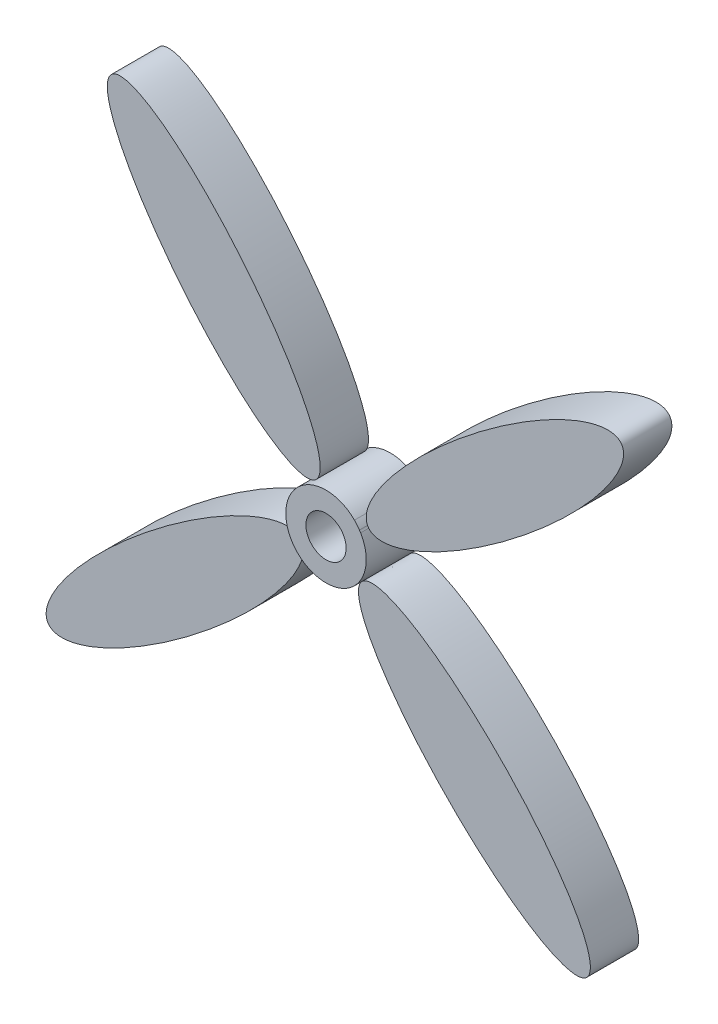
ISO-10303-21;
HEADER;
FILE_DESCRIPTION(('STEP AP214'),'2;1');
FILE_NAME('part.step','',(''),(''),'','','');
FILE_SCHEMA(('AUTOMOTIVE_DESIGN { 1 0 10303 214 1 1 1 1 }'));
ENDSEC;
DATA;
#1=APPLICATION_CONTEXT('core data for automotive mechanical design processes');
#2=APPLICATION_PROTOCOL_DEFINITION('international standard','automotive_design',2000,#1);
#3=PRODUCT_CONTEXT('',#1,'mechanical');
#4=PRODUCT('Part','Part','',(#3));
#5=PRODUCT_RELATED_PRODUCT_CATEGORY('part','',(#4));
#6=PRODUCT_DEFINITION_FORMATION('','',#4);
#7=PRODUCT_DEFINITION_CONTEXT('part definition',#1,'design');
#8=PRODUCT_DEFINITION('design','',#6,#7);
#9=PRODUCT_DEFINITION_SHAPE('','',#8);
#10=(LENGTH_UNIT() NAMED_UNIT(*) SI_UNIT(.MILLI.,.METRE.));
#11=(NAMED_UNIT(*) PLANE_ANGLE_UNIT() SI_UNIT($,.RADIAN.));
#12=(NAMED_UNIT(*) SI_UNIT($,.STERADIAN.) SOLID_ANGLE_UNIT());
#13=UNCERTAINTY_MEASURE_WITH_UNIT(LENGTH_MEASURE(1.E-05),#10,'distance_accuracy_value','');
#14=(GEOMETRIC_REPRESENTATION_CONTEXT(3) GLOBAL_UNCERTAINTY_ASSIGNED_CONTEXT((#13)) GLOBAL_UNIT_ASSIGNED_CONTEXT((#10,
#11,#12)) REPRESENTATION_CONTEXT('',''));
#15=CARTESIAN_POINT('',(0.,0.,0.));
#16=DIRECTION('',(0.,0.,1.));
#17=DIRECTION('',(1.,0.,0.));
#18=AXIS2_PLACEMENT_3D('',#15,#16,#17);
#19=CARTESIAN_POINT('',(-9.49213863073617,12.6733773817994,-1.905));
#20=DIRECTION('',(0.,0.,1.));
#21=DIRECTION('',(0.632158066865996,-0.774839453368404,0.));
#22=AXIS2_PLACEMENT_3D('',#19,#20,#21);
#23=ELLIPSE('',#22,12.7,3.175);
#24=DIRECTION('',(0.,0.,1.));
#25=VECTOR('',#24,1.);
#26=SURFACE_OF_LINEAR_EXTRUSION('',#23,#25);
#27=CARTESIAN_POINT('',(-1.46373118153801,2.83291632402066,-1.905));
#28=VERTEX_POINT('',#27);
#29=EDGE_CURVE('E49',#28,#28,#23,.T.);
#30=ORIENTED_EDGE('',*,*,#29,.T.);
#31=EDGE_LOOP('',(#30));
#32=FACE_BOUND('',#31,.T.);
#33=CARTESIAN_POINT('',(-9.49213863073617,12.6733773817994,1.905));
#34=DIRECTION('',(0.,0.,1.));
#35=DIRECTION('',(0.632158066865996,-0.774839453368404,0.));
#36=AXIS2_PLACEMENT_3D('',#33,#34,#35);
#37=ELLIPSE('',#36,12.7,3.175);
#38=CARTESIAN_POINT('',(-1.46373118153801,2.83291632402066,1.905));
#39=VERTEX_POINT('',#38);
#40=EDGE_CURVE('E11',#39,#39,#37,.T.);
#41=ORIENTED_EDGE('',*,*,#40,.F.);
#42=EDGE_LOOP('',(#41));
#43=FACE_BOUND('',#42,.T.);
#44=ADVANCED_FACE('F42',(#32,#43),#26,.T.);
#45=CARTESIAN_POINT('',(-9.49213863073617,12.6733773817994,-1.905));
#46=DIRECTION('',(0.,0.,1.));
#47=DIRECTION('',(1.,0.,0.));
#48=AXIS2_PLACEMENT_3D('',#45,#46,#47);
#49=PLANE('',#48);
#50=ORIENTED_EDGE('',*,*,#29,.F.);
#51=EDGE_LOOP('',(#50));
#52=FACE_BOUND('',#51,.T.);
#53=ADVANCED_FACE('F58',(#52),#49,.F.);
#54=CARTESIAN_POINT('',(-9.49213863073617,12.6733773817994,1.905));
#55=DIRECTION('',(0.,0.,1.));
#56=DIRECTION('',(1.,0.,0.));
#57=AXIS2_PLACEMENT_3D('',#54,#55,#56);
#58=PLANE('',#57);
#59=ORIENTED_EDGE('',*,*,#40,.T.);
#60=EDGE_LOOP('',(#59));
#61=FACE_BOUND('',#60,.T.);
#62=ADVANCED_FACE('F44',(#61),#58,.T.);
#63=CLOSED_SHELL('',(#44,#53,#62));
#64=MANIFOLD_SOLID_BREP('B2',#63);
#65=CARTESIAN_POINT('',(0.000999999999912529,-0.00100000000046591,-1.905));
#66=DIRECTION('',(0.,0.,1.));
#67=DIRECTION('',(1.,0.,0.));
#68=AXIS2_PLACEMENT_3D('',#65,#66,#67);
#69=CYLINDRICAL_SURFACE('',#68,3.175);
#70=DIRECTION('',(0.,0.,1.));
#71=VECTOR('',#70,1.);
#72=CARTESIAN_POINT('',(2.18524674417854,-2.30527671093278,-1.905));
#73=LINE('',#72,#71);
#74=CARTESIAN_POINT('',(2.18524674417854,-2.30527671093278,-1.905));
#75=VERTEX_POINT('',#74);
#76=CARTESIAN_POINT('',(2.18524674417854,-2.30527671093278,1.905));
#77=VERTEX_POINT('',#76);
#78=EDGE_CURVE('E122',#75,#77,#73,.T.);
#79=ORIENTED_EDGE('',*,*,#78,.T.);
#80=CARTESIAN_POINT('',(0.000999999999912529,-0.00100000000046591,1.905));
#81=DIRECTION('',(0.,0.,1.));
#82=DIRECTION('',(1.,0.,0.));
#83=AXIS2_PLACEMENT_3D('',#80,#81,#82);
#84=CIRCLE('',#83,3.175);
#85=CARTESIAN_POINT('',(2.24597169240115,-2.24615609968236,1.905));
#86=VERTEX_POINT('',#85);
#87=EDGE_CURVE('E40',#77,#86,#84,.T.);
#88=ORIENTED_EDGE('',*,*,#87,.T.);
#89=CARTESIAN_POINT('',(2.24597170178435,-2.24615609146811,0.));
#90=DIRECTION('',(0.,0.,1.));
#91=VECTOR('',#90,1.);
#92=LINE('',#89,#91);
#93=CARTESIAN_POINT('',(2.24597169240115,-2.24615609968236,0.));
#94=VERTEX_POINT('',#93);
#95=EDGE_CURVE('E131',#86,#94,#92,.F.);
#96=ORIENTED_EDGE('',*,*,#95,.T.);
#97=CARTESIAN_POINT('',(2.24597169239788,-2.24615609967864,-1.905));
#98=DIRECTION('',(0.,0.,1.));
#99=VECTOR('',#98,1.);
#100=LINE('',#97,#99);
#101=CARTESIAN_POINT('',(2.24597169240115,-2.24615609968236,-1.905));
#102=VERTEX_POINT('',#101);
#103=EDGE_CURVE('E108',#102,#94,#100,.T.);
#104=ORIENTED_EDGE('',*,*,#103,.F.);
#105=CARTESIAN_POINT('',(0.000999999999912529,-0.00100000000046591,-1.905));
#106=DIRECTION('',(0.,0.,1.));
#107=DIRECTION('',(1.,0.,0.));
#108=AXIS2_PLACEMENT_3D('',#105,#106,#107);
#109=CIRCLE('',#108,3.175);
#110=EDGE_CURVE('E127',#75,#102,#109,.T.);
#111=ORIENTED_EDGE('',*,*,#110,.F.);
#112=EDGE_LOOP('',(#79,#88,#96,#104,#111));
#113=FACE_BOUND('',#112,.T.);
#114=ADVANCED_FACE('F92',(#113),#69,.F.);
#115=CARTESIAN_POINT('',(11.074092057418,-11.3745377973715,-1.905));
#116=DIRECTION('',(0.,0.,1.));
#117=DIRECTION('',(-0.697580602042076,0.71650631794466,0.));
#118=AXIS2_PLACEMENT_3D('',#115,#116,#117);
#119=ELLIPSE('',#118,12.7,3.17500000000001);
#120=DIRECTION('',(0.,0.,1.));
#121=VECTOR('',#120,1.);
#122=SURFACE_OF_LINEAR_EXTRUSION('',#119,#121);
#123=ORIENTED_EDGE('',*,*,#103,.T.);
#124=ORIENTED_EDGE('',*,*,#95,.F.);
#125=CARTESIAN_POINT('',(11.074092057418,-11.3745377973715,1.905));
#126=DIRECTION('',(0.,0.,1.));
#127=DIRECTION('',(-0.697580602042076,0.71650631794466,0.));
#128=AXIS2_PLACEMENT_3D('',#125,#126,#127);
#129=ELLIPSE('',#128,12.7,3.17500000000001);
#130=EDGE_CURVE('E101',#77,#86,#129,.T.);
#131=ORIENTED_EDGE('',*,*,#130,.F.);
#132=ORIENTED_EDGE('',*,*,#78,.F.);
#133=EDGE_CURVE('E129',#75,#102,#119,.T.);
#134=ORIENTED_EDGE('',*,*,#133,.T.);
#135=EDGE_LOOP('',(#123,#124,#131,#132,#134));
#136=FACE_BOUND('',#135,.T.);
#137=ADVANCED_FACE('F137',(#136),#122,.T.);
#138=CARTESIAN_POINT('',(3.18470379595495,-52.3188134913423,-1.905));
#139=DIRECTION('',(0.,0.,1.));
#140=DIRECTION('',(1.,0.,0.));
#141=AXIS2_PLACEMENT_3D('',#138,#139,#140);
#142=PLANE('',#141);
#143=ORIENTED_EDGE('',*,*,#110,.T.);
#144=ORIENTED_EDGE('',*,*,#133,.F.);
#145=EDGE_LOOP('',(#143,#144));
#146=FACE_BOUND('',#145,.T.);
#147=ADVANCED_FACE('F128',(#146),#142,.F.);
#148=CARTESIAN_POINT('',(3.18470379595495,-52.3188134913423,1.905));
#149=DIRECTION('',(0.,0.,1.));
#150=DIRECTION('',(1.,0.,0.));
#151=AXIS2_PLACEMENT_3D('',#148,#149,#150);
#152=PLANE('',#151);
#153=ORIENTED_EDGE('',*,*,#87,.F.);
#154=ORIENTED_EDGE('',*,*,#130,.T.);
#155=EDGE_LOOP('',(#153,#154));
#156=FACE_BOUND('',#155,.T.);
#157=ADVANCED_FACE('F94',(#156),#152,.T.);
#158=CLOSED_SHELL('',(#114,#137,#147,#157));
#159=MANIFOLD_SOLID_BREP('B6',#158);
#160=CARTESIAN_POINT('',(-12.5640249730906,-9.69799775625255,-1.905));
#161=DIRECTION('',(0.,0.,1.));
#162=DIRECTION('',(0.784187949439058,0.620523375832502,0.));
#163=AXIS2_PLACEMENT_3D('',#160,#161,#162);
#164=ELLIPSE('',#163,12.7,3.175);
#165=DIRECTION('',(0.,0.,1.));
#166=VECTOR('',#165,1.);
#167=SURFACE_OF_LINEAR_EXTRUSION('',#164,#166);
#168=CARTESIAN_POINT('',(-2.60483801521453,-1.81735088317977,-1.905));
#169=VERTEX_POINT('',#168);
#170=EDGE_CURVE('E234',#169,#169,#164,.T.);
#171=ORIENTED_EDGE('',*,*,#170,.T.);
#172=EDGE_LOOP('',(#171));
#173=FACE_BOUND('',#172,.T.);
#174=CARTESIAN_POINT('',(-12.5640249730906,-9.69799775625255,1.905));
#175=DIRECTION('',(0.,0.,1.));
#176=DIRECTION('',(0.784187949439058,0.620523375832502,0.));
#177=AXIS2_PLACEMENT_3D('',#174,#175,#176);
#178=ELLIPSE('',#177,12.7,3.175);
#179=CARTESIAN_POINT('',(-2.60483801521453,-1.81735088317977,1.905));
#180=VERTEX_POINT('',#179);
#181=EDGE_CURVE('E91',#180,#180,#178,.T.);
#182=ORIENTED_EDGE('',*,*,#181,.F.);
#183=EDGE_LOOP('',(#182));
#184=FACE_BOUND('',#183,.T.);
#185=ADVANCED_FACE('F227',(#173,#184),#167,.T.);
#186=CARTESIAN_POINT('',(3.18470379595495,-52.3188134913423,-1.905));
#187=DIRECTION('',(0.,0.,1.));
#188=DIRECTION('',(1.,0.,0.));
#189=AXIS2_PLACEMENT_3D('',#186,#187,#188);
#190=PLANE('',#189);
#191=ORIENTED_EDGE('',*,*,#170,.F.);
#192=EDGE_LOOP('',(#191));
#193=FACE_BOUND('',#192,.T.);
#194=ADVANCED_FACE('F243',(#193),#190,.F.);
#195=CARTESIAN_POINT('',(3.18470379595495,-52.3188134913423,1.905));
#196=DIRECTION('',(0.,0.,1.));
#197=DIRECTION('',(1.,0.,0.));
#198=AXIS2_PLACEMENT_3D('',#195,#196,#197);
#199=PLANE('',#198);
#200=ORIENTED_EDGE('',*,*,#181,.T.);
#201=EDGE_LOOP('',(#200));
#202=FACE_BOUND('',#201,.T.);
#203=ADVANCED_FACE('F229',(#202),#199,.T.);
#204=CLOSED_SHELL('',(#185,#194,#203));
#205=MANIFOLD_SOLID_BREP('B34',#204);
#206=CARTESIAN_POINT('',(0.002,0.,-1.905));
#207=DIRECTION('',(0.,0.,1.));
#208=DIRECTION('',(1.,0.,0.));
#209=AXIS2_PLACEMENT_3D('',#206,#207,#208);
#210=CYLINDRICAL_SURFACE('',#209,3.1750000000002);
#211=DIRECTION('',(0.,0.,1.));
#212=VECTOR('',#211,1.);
#213=CARTESIAN_POINT('',(2.73825756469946,1.61044079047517,-1.905));
#214=LINE('',#213,#212);
#215=CARTESIAN_POINT('',(2.73825756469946,1.61044079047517,-1.905));
#216=VERTEX_POINT('',#215);
#217=CARTESIAN_POINT('',(2.73825756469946,1.61044079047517,1.905));
#218=VERTEX_POINT('',#217);
#219=EDGE_CURVE('E281',#216,#218,#214,.T.);
#220=ORIENTED_EDGE('',*,*,#219,.T.);
#221=CARTESIAN_POINT('',(0.002,0.,1.905));
#222=DIRECTION('',(0.,0.,1.));
#223=DIRECTION('',(1.,0.,0.));
#224=AXIS2_PLACEMENT_3D('',#221,#222,#223);
#225=CIRCLE('',#224,3.1750000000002);
#226=CARTESIAN_POINT('',(2.63416028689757,1.77548788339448,1.905));
#227=VERTEX_POINT('',#226);
#228=EDGE_CURVE('E305',#218,#227,#225,.T.);
#229=ORIENTED_EDGE('',*,*,#228,.T.);
#230=DIRECTION('',(0.,0.,1.));
#231=VECTOR('',#230,1.);
#232=CARTESIAN_POINT('',(2.63416028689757,1.77548788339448,-1.905));
#233=LINE('',#232,#231);
#234=CARTESIAN_POINT('',(2.63416028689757,1.77548788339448,-1.905));
#235=VERTEX_POINT('',#234);
#236=EDGE_CURVE('E225',#235,#227,#233,.T.);
#237=ORIENTED_EDGE('',*,*,#236,.F.);
#238=CARTESIAN_POINT('',(0.002,0.,-1.905));
#239=DIRECTION('',(0.,0.,1.));
#240=DIRECTION('',(1.,0.,0.));
#241=AXIS2_PLACEMENT_3D('',#238,#239,#240);
#242=CIRCLE('',#241,3.1750000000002);
#243=EDGE_CURVE('E291',#216,#235,#242,.T.);
#244=ORIENTED_EDGE('',*,*,#243,.F.);
#245=EDGE_LOOP('',(#220,#229,#237,#244));
#246=FACE_BOUND('',#245,.T.);
#247=ADVANCED_FACE('F278',(#246),#210,.F.);
#248=CARTESIAN_POINT('',(12.6898923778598,9.50048418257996,-1.905));
#249=DIRECTION('',(0.,0.,1.));
#250=DIRECTION('',(-0.784187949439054,-0.620523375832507,0.));
#251=AXIS2_PLACEMENT_3D('',#248,#249,#250);
#252=ELLIPSE('',#251,12.7,3.175);
#253=DIRECTION('',(0.,0.,1.));
#254=VECTOR('',#253,1.);
#255=SURFACE_OF_LINEAR_EXTRUSION('',#252,#254);
#256=ORIENTED_EDGE('',*,*,#236,.T.);
#257=CARTESIAN_POINT('',(12.6898923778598,9.50048418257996,1.905));
#258=DIRECTION('',(0.,0.,1.));
#259=DIRECTION('',(-0.784187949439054,-0.620523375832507,0.));
#260=AXIS2_PLACEMENT_3D('',#257,#258,#259);
#261=ELLIPSE('',#260,12.7,3.175);
#262=EDGE_CURVE('E308',#218,#227,#261,.T.);
#263=ORIENTED_EDGE('',*,*,#262,.F.);
#264=ORIENTED_EDGE('',*,*,#219,.F.);
#265=EDGE_CURVE('E306',#216,#235,#252,.T.);
#266=ORIENTED_EDGE('',*,*,#265,.T.);
#267=EDGE_LOOP('',(#256,#263,#264,#266));
#268=FACE_BOUND('',#267,.T.);
#269=ADVANCED_FACE('F309',(#268),#255,.T.);
#270=CARTESIAN_POINT('',(3.18470379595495,-52.3188134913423,-1.905));
#271=DIRECTION('',(0.,0.,1.));
#272=DIRECTION('',(1.,0.,0.));
#273=AXIS2_PLACEMENT_3D('',#270,#271,#272);
#274=PLANE('',#273);
#275=ORIENTED_EDGE('',*,*,#243,.T.);
#276=ORIENTED_EDGE('',*,*,#265,.F.);
#277=EDGE_LOOP('',(#275,#276));
#278=FACE_BOUND('',#277,.T.);
#279=ADVANCED_FACE('F319',(#278),#274,.F.);
#280=CARTESIAN_POINT('',(3.18470379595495,-52.3188134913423,1.905));
#281=DIRECTION('',(0.,0.,1.));
#282=DIRECTION('',(1.,0.,0.));
#283=AXIS2_PLACEMENT_3D('',#280,#281,#282);
#284=PLANE('',#283);
#285=ORIENTED_EDGE('',*,*,#228,.F.);
#286=ORIENTED_EDGE('',*,*,#262,.T.);
#287=EDGE_LOOP('',(#285,#286));
#288=FACE_BOUND('',#287,.T.);
#289=ADVANCED_FACE('F312',(#288),#284,.T.);
#290=CLOSED_SHELL('',(#247,#269,#279,#289));
#291=MANIFOLD_SOLID_BREP('B86',#290);
#292=CARTESIAN_POINT('',(12.6898923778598,9.50048418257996,-2.54));
#293=DIRECTION('',(0.,0.,1.));
#294=DIRECTION('',(-0.784187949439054,-0.620523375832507,0.));
#295=AXIS2_PLACEMENT_3D('',#292,#293,#294);
#296=ELLIPSE('',#295,12.7,3.175);
#297=DIRECTION('',(0.,0.,1.));
#298=VECTOR('',#297,1.);
#299=SURFACE_OF_LINEAR_EXTRUSION('',#296,#298);
#300=DIRECTION('',(0.,0.,1.));
#301=VECTOR('',#300,1.);
#302=CARTESIAN_POINT('',(2.63931479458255,1.76483495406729,-2.54));
#303=LINE('',#302,#301);
#304=CARTESIAN_POINT('',(2.63931479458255,1.76483495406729,-2.54));
#305=VERTEX_POINT('',#304);
#306=CARTESIAN_POINT('',(2.63931479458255,1.76483495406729,2.54));
#307=VERTEX_POINT('',#306);
#308=EDGE_CURVE('E355',#305,#307,#303,.T.);
#309=ORIENTED_EDGE('',*,*,#308,.T.);
#310=CARTESIAN_POINT('',(12.6898923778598,9.50048418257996,2.54));
#311=DIRECTION('',(0.,0.,1.));
#312=DIRECTION('',(-0.784187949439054,-0.620523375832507,0.));
#313=AXIS2_PLACEMENT_3D('',#310,#311,#312);
#314=ELLIPSE('',#313,12.7,3.175);
#315=CARTESIAN_POINT('',(2.73070541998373,1.61983730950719,2.54));
#316=VERTEX_POINT('',#315);
#317=EDGE_CURVE('E408',#307,#316,#314,.T.);
#318=ORIENTED_EDGE('',*,*,#317,.T.);
#319=DIRECTION('',(0.,0.,1.));
#320=VECTOR('',#319,1.);
#321=CARTESIAN_POINT('',(2.73070541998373,1.61983730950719,-2.54));
#322=LINE('',#321,#320);
#323=CARTESIAN_POINT('',(2.73070541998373,1.61983730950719,-2.54));
#324=VERTEX_POINT('',#323);
#325=EDGE_CURVE('E276',#324,#316,#322,.T.);
#326=ORIENTED_EDGE('',*,*,#325,.F.);
#327=EDGE_CURVE('E368',#305,#324,#296,.T.);
#328=ORIENTED_EDGE('',*,*,#327,.F.);
#329=EDGE_LOOP('',(#309,#318,#326,#328));
#330=FACE_BOUND('',#329,.T.);
#331=ADVANCED_FACE('F351',(#330),#299,.F.);
#332=CARTESIAN_POINT('',(0.,0.,-2.54));
#333=DIRECTION('',(0.,0.,1.));
#334=DIRECTION('',(1.,0.,0.));
#335=AXIS2_PLACEMENT_3D('',#332,#333,#334);
#336=CYLINDRICAL_SURFACE('',#335,3.175);
#337=ORIENTED_EDGE('',*,*,#325,.T.);
#338=CARTESIAN_POINT('',(0.,0.,2.54));
#339=DIRECTION('',(0.,0.,1.));
#340=DIRECTION('',(1.,0.,0.));
#341=AXIS2_PLACEMENT_3D('',#338,#339,#340);
#342=CIRCLE('',#341,3.175);
#343=CARTESIAN_POINT('',(2.24556397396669,-2.24456397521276,2.54));
#344=VERTEX_POINT('',#343);
#345=EDGE_CURVE('E421',#344,#316,#342,.T.);
#346=ORIENTED_EDGE('',*,*,#345,.F.);
#347=DIRECTION('',(0.,0.,1.));
#348=VECTOR('',#347,1.);
#349=CARTESIAN_POINT('',(2.24556397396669,-2.24456397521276,-2.54));
#350=LINE('',#349,#348);
#351=CARTESIAN_POINT('',(2.24556397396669,-2.24456397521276,-2.54));
#352=VERTEX_POINT('',#351);
#353=EDGE_CURVE('E360',#352,#344,#350,.T.);
#354=ORIENTED_EDGE('',*,*,#353,.F.);
#355=CARTESIAN_POINT('',(0.,0.,-2.54));
#356=DIRECTION('',(0.,0.,1.));
#357=DIRECTION('',(1.,0.,0.));
#358=AXIS2_PLACEMENT_3D('',#355,#356,#357);
#359=CIRCLE('',#358,3.175);
#360=EDGE_CURVE('E412',#352,#324,#359,.T.);
#361=ORIENTED_EDGE('',*,*,#360,.T.);
#362=EDGE_LOOP('',(#337,#346,#354,#361));
#363=FACE_BOUND('',#362,.T.);
#364=ADVANCED_FACE('F465',(#363),#336,.T.);
#365=CARTESIAN_POINT('',(0.00100000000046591,0.000999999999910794,-2.54));
#366=DIRECTION('',(0.,0.,1.));
#367=DIRECTION('',(1.,0.,0.));
#368=AXIS2_PLACEMENT_3D('',#365,#366,#367);
#369=CYLINDRICAL_SURFACE('',#368,3.175);
#370=ORIENTED_EDGE('',*,*,#353,.T.);
#371=CARTESIAN_POINT('',(0.00100000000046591,0.000999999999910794,2.54));
#372=DIRECTION('',(0.,0.,1.));
#373=DIRECTION('',(1.,0.,0.));
#374=AXIS2_PLACEMENT_3D('',#371,#372,#373);
#375=CIRCLE('',#374,3.175);
#376=CARTESIAN_POINT('',(-2.24356397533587,-2.24456397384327,2.54));
#377=VERTEX_POINT('',#376);
#378=EDGE_CURVE('E436',#377,#344,#375,.T.);
#379=ORIENTED_EDGE('',*,*,#378,.F.);
#380=DIRECTION('',(0.,0.,1.));
#381=VECTOR('',#380,1.);
#382=CARTESIAN_POINT('',(-2.24356397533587,-2.24456397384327,-2.54));
#383=LINE('',#382,#381);
#384=CARTESIAN_POINT('',(-2.24356397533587,-2.24456397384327,-2.54));
#385=VERTEX_POINT('',#384);
#386=EDGE_CURVE('E450',#385,#377,#383,.T.);
#387=ORIENTED_EDGE('',*,*,#386,.F.);
#388=CARTESIAN_POINT('',(0.00100000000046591,0.000999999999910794,-2.54));
#389=DIRECTION('',(0.,0.,1.));
#390=DIRECTION('',(1.,0.,0.));
#391=AXIS2_PLACEMENT_3D('',#388,#389,#390);
#392=CIRCLE('',#391,3.175);
#393=EDGE_CURVE('E447',#385,#352,#392,.T.);
#394=ORIENTED_EDGE('',*,*,#393,.T.);
#395=EDGE_LOOP('',(#370,#379,#387,#394));
#396=FACE_BOUND('',#395,.T.);
#397=ADVANCED_FACE('F463',(#396),#369,.T.);
#398=CARTESIAN_POINT('',(0.002,0.,-2.54));
#399=DIRECTION('',(0.,0.,1.));
#400=DIRECTION('',(1.,0.,0.));
#401=AXIS2_PLACEMENT_3D('',#398,#399,#400);
#402=CYLINDRICAL_SURFACE('',#401,3.1750000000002);
#403=ORIENTED_EDGE('',*,*,#386,.T.);
#404=CARTESIAN_POINT('',(0.002,0.,2.54));
#405=DIRECTION('',(0.,0.,1.));
#406=DIRECTION('',(1.,0.,0.));
#407=AXIS2_PLACEMENT_3D('',#404,#405,#406);
#408=CIRCLE('',#407,3.1750000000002);
#409=CARTESIAN_POINT('',(-2.24356397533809,2.24456397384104,2.54));
#410=VERTEX_POINT('',#409);
#411=EDGE_CURVE('E433',#410,#377,#408,.T.);
#412=ORIENTED_EDGE('',*,*,#411,.F.);
#413=DIRECTION('',(0.,0.,1.));
#414=VECTOR('',#413,1.);
#415=CARTESIAN_POINT('',(-2.24356397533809,2.24456397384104,-2.54));
#416=LINE('',#415,#414);
#417=CARTESIAN_POINT('',(-2.24356397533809,2.24456397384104,-2.54));
#418=VERTEX_POINT('',#417);
#419=EDGE_CURVE('E452',#418,#410,#416,.T.);
#420=ORIENTED_EDGE('',*,*,#419,.F.);
#421=CARTESIAN_POINT('',(0.002,0.,-2.54));
#422=DIRECTION('',(0.,0.,1.));
#423=DIRECTION('',(1.,0.,0.));
#424=AXIS2_PLACEMENT_3D('',#421,#422,#423);
#425=CIRCLE('',#424,3.1750000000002);
#426=EDGE_CURVE('E444',#418,#385,#425,.T.);
#427=ORIENTED_EDGE('',*,*,#426,.T.);
#428=EDGE_LOOP('',(#403,#412,#420,#427));
#429=FACE_BOUND('',#428,.T.);
#430=ADVANCED_FACE('F460',(#429),#402,.T.);
#431=CARTESIAN_POINT('',(0.000999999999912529,-0.00100000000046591,-2.54));
#432=DIRECTION('',(0.,0.,1.));
#433=DIRECTION('',(1.,0.,0.));
#434=AXIS2_PLACEMENT_3D('',#431,#432,#433);
#435=CYLINDRICAL_SURFACE('',#434,3.175);
#436=ORIENTED_EDGE('',*,*,#419,.T.);
#437=CARTESIAN_POINT('',(0.000999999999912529,-0.00100000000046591,2.54));
#438=DIRECTION('',(0.,0.,1.));
#439=DIRECTION('',(1.,0.,0.));
#440=AXIS2_PLACEMENT_3D('',#437,#438,#439);
#441=CIRCLE('',#440,3.175);
#442=CARTESIAN_POINT('',(2.24556397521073,2.24456397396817,2.54));
#443=VERTEX_POINT('',#442);
#444=EDGE_CURVE('E419',#443,#410,#441,.T.);
#445=ORIENTED_EDGE('',*,*,#444,.F.);
#446=DIRECTION('',(0.,0.,1.));
#447=VECTOR('',#446,1.);
#448=CARTESIAN_POINT('',(2.24556397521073,2.24456397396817,-2.54));
#449=LINE('',#448,#447);
#450=CARTESIAN_POINT('',(2.24556397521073,2.24456397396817,-2.54));
#451=VERTEX_POINT('',#450);
#452=EDGE_CURVE('E411',#451,#443,#449,.T.);
#453=ORIENTED_EDGE('',*,*,#452,.F.);
#454=CARTESIAN_POINT('',(0.000999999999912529,-0.00100000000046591,-2.54));
#455=DIRECTION('',(0.,0.,1.));
#456=DIRECTION('',(1.,0.,0.));
#457=AXIS2_PLACEMENT_3D('',#454,#455,#456);
#458=CIRCLE('',#457,3.175);
#459=EDGE_CURVE('E441',#451,#418,#458,.T.);
#460=ORIENTED_EDGE('',*,*,#459,.T.);
#461=EDGE_LOOP('',(#436,#445,#453,#460));
#462=FACE_BOUND('',#461,.T.);
#463=ADVANCED_FACE('F454',(#462),#435,.T.);
#464=ORIENTED_EDGE('',*,*,#452,.T.);
#465=EDGE_CURVE('E414',#307,#443,#342,.T.);
#466=ORIENTED_EDGE('',*,*,#465,.F.);
#467=ORIENTED_EDGE('',*,*,#308,.F.);
#468=EDGE_CURVE('E439',#305,#451,#359,.T.);
#469=ORIENTED_EDGE('',*,*,#468,.T.);
#470=EDGE_LOOP('',(#464,#466,#467,#469));
#471=FACE_BOUND('',#470,.T.);
#472=ADVANCED_FACE('F415',(#471),#336,.T.);
#473=CARTESIAN_POINT('',(3.18470379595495,-52.3188134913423,-2.54));
#474=DIRECTION('',(0.,0.,1.));
#475=DIRECTION('',(1.,0.,0.));
#476=AXIS2_PLACEMENT_3D('',#473,#474,#475);
#477=PLANE('',#476);
#478=CARTESIAN_POINT('',(0.,0.,-2.54));
#479=DIRECTION('',(0.,0.,1.));
#480=DIRECTION('',(1.,0.,0.));
#481=AXIS2_PLACEMENT_3D('',#478,#479,#480);
#482=CIRCLE('',#481,1.5875);
#483=CARTESIAN_POINT('',(1.5875,0.,-2.54));
#484=VERTEX_POINT('',#483);
#485=EDGE_CURVE('E425',#484,#484,#482,.T.);
#486=ORIENTED_EDGE('',*,*,#485,.T.);
#487=EDGE_LOOP('',(#486));
#488=FACE_BOUND('',#487,.T.);
#489=ORIENTED_EDGE('',*,*,#327,.T.);
#490=ORIENTED_EDGE('',*,*,#360,.F.);
#491=ORIENTED_EDGE('',*,*,#393,.F.);
#492=ORIENTED_EDGE('',*,*,#426,.F.);
#493=ORIENTED_EDGE('',*,*,#459,.F.);
#494=ORIENTED_EDGE('',*,*,#468,.F.);
#495=EDGE_LOOP('',(#489,#490,#491,#492,#493,#494));
#496=FACE_BOUND('',#495,.T.);
#497=ADVANCED_FACE('F464',(#488,#496),#477,.F.);
#498=CARTESIAN_POINT('',(3.18470379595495,-52.3188134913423,2.54));
#499=DIRECTION('',(0.,0.,1.));
#500=DIRECTION('',(1.,0.,0.));
#501=AXIS2_PLACEMENT_3D('',#498,#499,#500);
#502=PLANE('',#501);
#503=CARTESIAN_POINT('',(0.,0.,2.54));
#504=DIRECTION('',(0.,0.,1.));
#505=DIRECTION('',(1.,0.,0.));
#506=AXIS2_PLACEMENT_3D('',#503,#504,#505);
#507=CIRCLE('',#506,1.5875);
#508=CARTESIAN_POINT('',(1.5875,0.,2.54));
#509=VERTEX_POINT('',#508);
#510=EDGE_CURVE('E428',#509,#509,#507,.T.);
#511=ORIENTED_EDGE('',*,*,#510,.F.);
#512=EDGE_LOOP('',(#511));
#513=FACE_BOUND('',#512,.T.);
#514=ORIENTED_EDGE('',*,*,#317,.F.);
#515=ORIENTED_EDGE('',*,*,#465,.T.);
#516=ORIENTED_EDGE('',*,*,#444,.T.);
#517=ORIENTED_EDGE('',*,*,#411,.T.);
#518=ORIENTED_EDGE('',*,*,#378,.T.);
#519=ORIENTED_EDGE('',*,*,#345,.T.);
#520=EDGE_LOOP('',(#514,#515,#516,#517,#518,#519));
#521=FACE_BOUND('',#520,.T.);
#522=ADVANCED_FACE('F423',(#513,#521),#502,.T.);
#523=CARTESIAN_POINT('',(0.,0.,-2.54));
#524=DIRECTION('',(0.,0.,1.));
#525=DIRECTION('',(1.,0.,0.));
#526=AXIS2_PLACEMENT_3D('',#523,#524,#525);
#527=CYLINDRICAL_SURFACE('',#526,1.5875);
#528=ORIENTED_EDGE('',*,*,#485,.F.);
#529=EDGE_LOOP('',(#528));
#530=FACE_BOUND('',#529,.T.);
#531=ORIENTED_EDGE('',*,*,#510,.T.);
#532=EDGE_LOOP('',(#531));
#533=FACE_BOUND('',#532,.T.);
#534=ADVANCED_FACE('F525',(#530,#533),#527,.F.);
#535=CLOSED_SHELL('',(#331,#364,#397,#430,#463,#472,#497,#522,#534));
#536=MANIFOLD_SOLID_BREP('B219',#535);
#537=ADVANCED_BREP_SHAPE_REPRESENTATION('',(#18,#64,#159,#205,#291,#536),#14);
#538=SHAPE_DEFINITION_REPRESENTATION(#9,#537);
ENDSEC;
END-ISO-10303-21;
